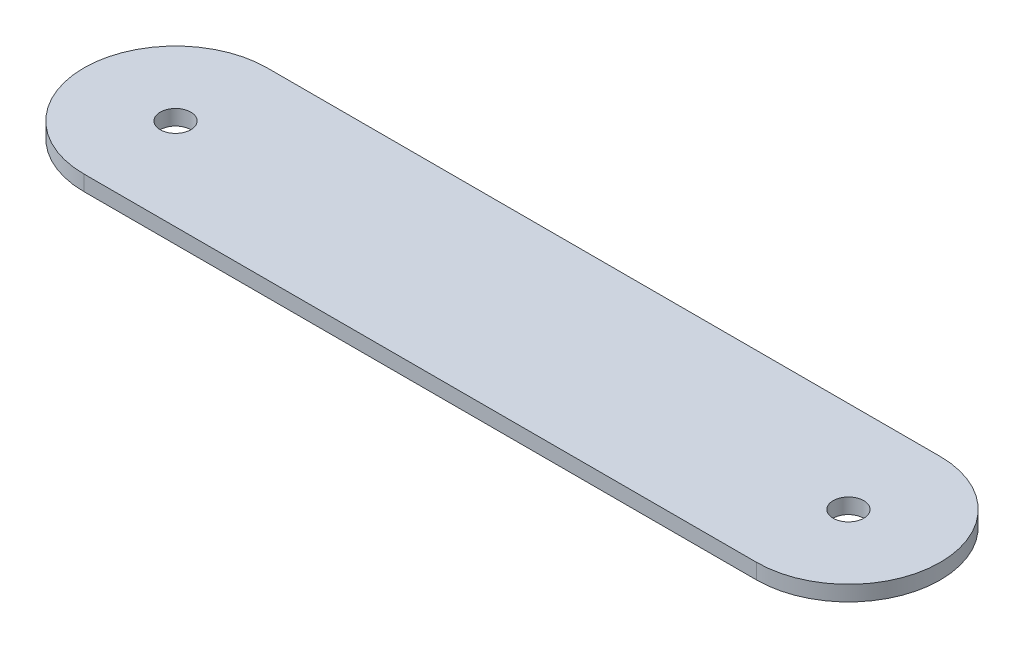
from build123d import *

# Parameters (mm, degrees)
SKETCH2_R           = 1
BOSS_EXTRUDE1_DEPTH = 1


with BuildPart() as part:
    # Sketch2 → Boss-Extrude1 (new body)
    with BuildSketch(Plane(origin=(0, 0, 0), x_dir=(1, 0, 0), z_dir=(0, 1, 0))):
        with BuildLine():
            Line((-22, 6), (22, 6))
            ThreePointArc((22, 6), (28, 0), (22, -6))
            Line((22, -6), (-22, -6))
            ThreePointArc((-22, -6), (-28, 0), (-22, 6))
        make_face()
        with Locations(Location((-22, 0, 0), (0, 0, 270))):
            Circle(SKETCH2_R, mode=Mode.SUBTRACT)
        with Locations(Location((22, 0, 0), (0, 0, 270))):
            Circle(SKETCH2_R, mode=Mode.SUBTRACT)
    extrude(amount=BOSS_EXTRUDE1_DEPTH)


solid = part.part
